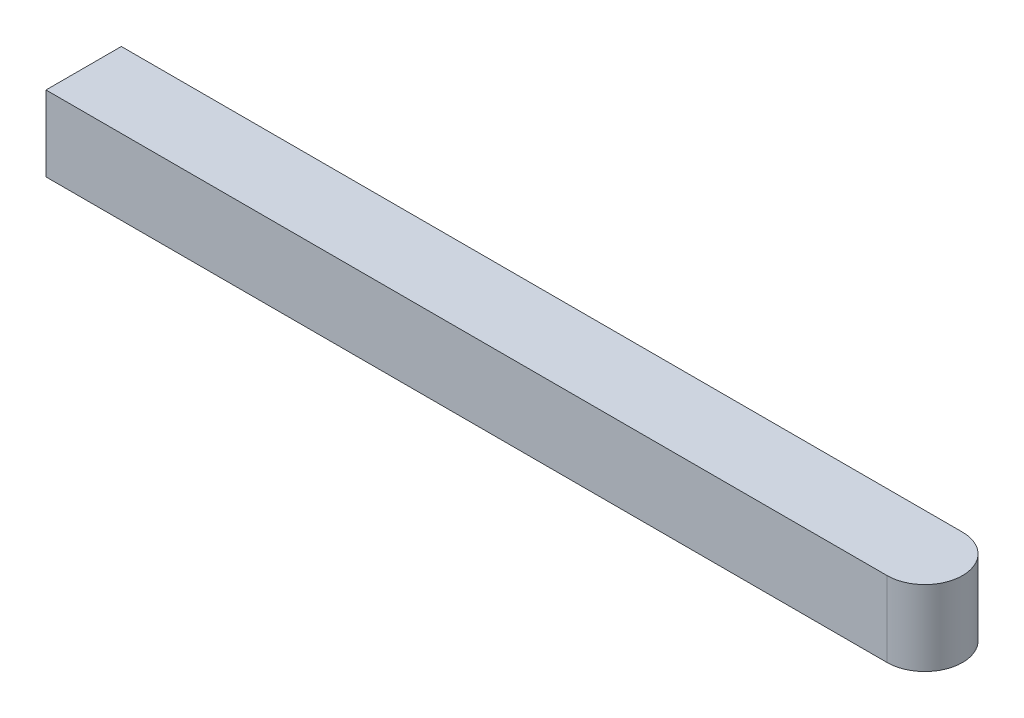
ISO-10303-21;
HEADER;
FILE_DESCRIPTION(('STEP AP214'),'2;1');
FILE_NAME('part.step','',(''),(''),'','','');
FILE_SCHEMA(('AUTOMOTIVE_DESIGN { 1 0 10303 214 1 1 1 1 }'));
ENDSEC;
DATA;
#1=APPLICATION_CONTEXT('core data for automotive mechanical design processes');
#2=APPLICATION_PROTOCOL_DEFINITION('international standard','automotive_design',2000,#1);
#3=PRODUCT_CONTEXT('',#1,'mechanical');
#4=PRODUCT('Part','Part','',(#3));
#5=PRODUCT_RELATED_PRODUCT_CATEGORY('part','',(#4));
#6=PRODUCT_DEFINITION_FORMATION('','',#4);
#7=PRODUCT_DEFINITION_CONTEXT('part definition',#1,'design');
#8=PRODUCT_DEFINITION('design','',#6,#7);
#9=PRODUCT_DEFINITION_SHAPE('','',#8);
#10=(LENGTH_UNIT() NAMED_UNIT(*) SI_UNIT(.MILLI.,.METRE.));
#11=(NAMED_UNIT(*) PLANE_ANGLE_UNIT() SI_UNIT($,.RADIAN.));
#12=(NAMED_UNIT(*) SI_UNIT($,.STERADIAN.) SOLID_ANGLE_UNIT());
#13=UNCERTAINTY_MEASURE_WITH_UNIT(LENGTH_MEASURE(1.E-05),#10,'distance_accuracy_value','');
#14=(GEOMETRIC_REPRESENTATION_CONTEXT(3) GLOBAL_UNCERTAINTY_ASSIGNED_CONTEXT((#13)) GLOBAL_UNIT_ASSIGNED_CONTEXT((#10,
#11,#12)) REPRESENTATION_CONTEXT('',''));
#15=CARTESIAN_POINT('',(0.,0.,0.));
#16=DIRECTION('',(0.,0.,1.));
#17=DIRECTION('',(1.,0.,0.));
#18=AXIS2_PLACEMENT_3D('',#15,#16,#17);
#19=CARTESIAN_POINT('',(0.,3.,-3.));
#20=DIRECTION('',(0.,0.,1.));
#21=DIRECTION('',(1.,0.,0.));
#22=AXIS2_PLACEMENT_3D('',#19,#20,#21);
#23=PLANE('',#22);
#24=DIRECTION('',(-1.,0.,0.));
#25=VECTOR('',#24,1.);
#26=CARTESIAN_POINT('',(0.,-3.,-3.));
#27=LINE('',#26,#25);
#28=CARTESIAN_POINT('',(67.,-3.,-3.));
#29=VERTEX_POINT('',#28);
#30=CARTESIAN_POINT('',(0.,-3.,-3.));
#31=VERTEX_POINT('',#30);
#32=EDGE_CURVE('E97',#29,#31,#27,.T.);
#33=ORIENTED_EDGE('',*,*,#32,.T.);
#34=DIRECTION('',(0.,-1.,0.));
#35=VECTOR('',#34,1.);
#36=CARTESIAN_POINT('',(0.,3.,-3.));
#37=LINE('',#36,#35);
#38=CARTESIAN_POINT('',(0.,3.,-3.));
#39=VERTEX_POINT('',#38);
#40=EDGE_CURVE('E11',#39,#31,#37,.T.);
#41=ORIENTED_EDGE('',*,*,#40,.F.);
#42=DIRECTION('',(-1.,0.,0.));
#43=VECTOR('',#42,1.);
#44=CARTESIAN_POINT('',(0.,3.,-3.));
#45=LINE('',#44,#43);
#46=CARTESIAN_POINT('',(67.,3.,-3.));
#47=VERTEX_POINT('',#46);
#48=EDGE_CURVE('E85',#47,#39,#45,.T.);
#49=ORIENTED_EDGE('',*,*,#48,.F.);
#50=DIRECTION('',(0.,-1.,0.));
#51=VECTOR('',#50,1.);
#52=CARTESIAN_POINT('',(67.,3.,-3.));
#53=LINE('',#52,#51);
#54=EDGE_CURVE('E93',#47,#29,#53,.T.);
#55=ORIENTED_EDGE('',*,*,#54,.T.);
#56=EDGE_LOOP('',(#33,#41,#49,#55));
#57=FACE_BOUND('',#56,.T.);
#58=ADVANCED_FACE('F34',(#57),#23,.F.);
#59=CARTESIAN_POINT('',(0.,3.,-3.));
#60=DIRECTION('',(1.,0.,0.));
#61=DIRECTION('',(0.,0.,-1.));
#62=AXIS2_PLACEMENT_3D('',#59,#60,#61);
#63=PLANE('',#62);
#64=DIRECTION('',(0.,0.,1.));
#65=VECTOR('',#64,1.);
#66=CARTESIAN_POINT('',(0.,-3.,-3.));
#67=LINE('',#66,#65);
#68=CARTESIAN_POINT('',(0.,-3.,3.));
#69=VERTEX_POINT('',#68);
#70=EDGE_CURVE('E89',#31,#69,#67,.T.);
#71=ORIENTED_EDGE('',*,*,#70,.T.);
#72=DIRECTION('',(0.,-1.,0.));
#73=VECTOR('',#72,1.);
#74=CARTESIAN_POINT('',(0.,3.,3.));
#75=LINE('',#74,#73);
#76=CARTESIAN_POINT('',(0.,3.,3.));
#77=VERTEX_POINT('',#76);
#78=EDGE_CURVE('E42',#77,#69,#75,.T.);
#79=ORIENTED_EDGE('',*,*,#78,.F.);
#80=DIRECTION('',(0.,0.,1.));
#81=VECTOR('',#80,1.);
#82=CARTESIAN_POINT('',(0.,3.,-3.));
#83=LINE('',#82,#81);
#84=EDGE_CURVE('E80',#39,#77,#83,.T.);
#85=ORIENTED_EDGE('',*,*,#84,.F.);
#86=ORIENTED_EDGE('',*,*,#40,.T.);
#87=EDGE_LOOP('',(#71,#79,#85,#86));
#88=FACE_BOUND('',#87,.T.);
#89=ADVANCED_FACE('F88',(#88),#63,.F.);
#90=CARTESIAN_POINT('',(67.,3.,3.));
#91=DIRECTION('',(0.,0.,-1.));
#92=DIRECTION('',(-1.,0.,0.));
#93=AXIS2_PLACEMENT_3D('',#90,#91,#92);
#94=PLANE('',#93);
#95=DIRECTION('',(1.,0.,0.));
#96=VECTOR('',#95,1.);
#97=CARTESIAN_POINT('',(67.,-3.,3.));
#98=LINE('',#97,#96);
#99=CARTESIAN_POINT('',(67.,-3.,3.));
#100=VERTEX_POINT('',#99);
#101=EDGE_CURVE('E67',#69,#100,#98,.T.);
#102=ORIENTED_EDGE('',*,*,#101,.T.);
#103=DIRECTION('',(0.,-1.,0.));
#104=VECTOR('',#103,1.);
#105=CARTESIAN_POINT('',(67.,3.,3.));
#106=LINE('',#105,#104);
#107=CARTESIAN_POINT('',(67.,3.,3.));
#108=VERTEX_POINT('',#107);
#109=EDGE_CURVE('E90',#108,#100,#106,.T.);
#110=ORIENTED_EDGE('',*,*,#109,.F.);
#111=DIRECTION('',(1.,0.,0.));
#112=VECTOR('',#111,1.);
#113=CARTESIAN_POINT('',(67.,3.,3.));
#114=LINE('',#113,#112);
#115=EDGE_CURVE('E83',#77,#108,#114,.T.);
#116=ORIENTED_EDGE('',*,*,#115,.F.);
#117=ORIENTED_EDGE('',*,*,#78,.T.);
#118=EDGE_LOOP('',(#102,#110,#116,#117));
#119=FACE_BOUND('',#118,.T.);
#120=ADVANCED_FACE('F91',(#119),#94,.F.);
#121=CARTESIAN_POINT('',(67.,3.,0.));
#122=DIRECTION('',(0.,-1.,0.));
#123=DIRECTION('',(0.,0.,-1.));
#124=AXIS2_PLACEMENT_3D('',#121,#122,#123);
#125=CYLINDRICAL_SURFACE('',#124,3.);
#126=CARTESIAN_POINT('',(67.,-3.,0.));
#127=DIRECTION('',(0.,1.,0.));
#128=DIRECTION('',(0.,0.,-1.));
#129=AXIS2_PLACEMENT_3D('',#126,#127,#128);
#130=CIRCLE('',#129,3.);
#131=EDGE_CURVE('E73',#100,#29,#130,.T.);
#132=ORIENTED_EDGE('',*,*,#131,.T.);
#133=ORIENTED_EDGE('',*,*,#54,.F.);
#134=CARTESIAN_POINT('',(67.,3.,0.));
#135=DIRECTION('',(0.,1.,0.));
#136=DIRECTION('',(0.,0.,-1.));
#137=AXIS2_PLACEMENT_3D('',#134,#135,#136);
#138=CIRCLE('',#137,3.);
#139=EDGE_CURVE('E50',#108,#47,#138,.T.);
#140=ORIENTED_EDGE('',*,*,#139,.F.);
#141=ORIENTED_EDGE('',*,*,#109,.T.);
#142=EDGE_LOOP('',(#132,#133,#140,#141));
#143=FACE_BOUND('',#142,.T.);
#144=ADVANCED_FACE('F104',(#143),#125,.T.);
#145=CARTESIAN_POINT('',(67.,3.,0.));
#146=DIRECTION('',(0.,-1.,0.));
#147=DIRECTION('',(0.,0.,-1.));
#148=AXIS2_PLACEMENT_3D('',#145,#146,#147);
#149=PLANE('',#148);
#150=ORIENTED_EDGE('',*,*,#48,.T.);
#151=ORIENTED_EDGE('',*,*,#84,.T.);
#152=ORIENTED_EDGE('',*,*,#115,.T.);
#153=ORIENTED_EDGE('',*,*,#139,.T.);
#154=EDGE_LOOP('',(#150,#151,#152,#153));
#155=FACE_BOUND('',#154,.T.);
#156=ADVANCED_FACE('F81',(#155),#149,.F.);
#157=CARTESIAN_POINT('',(67.,-3.,0.));
#158=DIRECTION('',(0.,-1.,0.));
#159=DIRECTION('',(0.,0.,-1.));
#160=AXIS2_PLACEMENT_3D('',#157,#158,#159);
#161=PLANE('',#160);
#162=ORIENTED_EDGE('',*,*,#32,.F.);
#163=ORIENTED_EDGE('',*,*,#131,.F.);
#164=ORIENTED_EDGE('',*,*,#101,.F.);
#165=ORIENTED_EDGE('',*,*,#70,.F.);
#166=EDGE_LOOP('',(#162,#163,#164,#165));
#167=FACE_BOUND('',#166,.T.);
#168=ADVANCED_FACE('F107',(#167),#161,.T.);
#169=CLOSED_SHELL('',(#58,#89,#120,#144,#156,#168));
#170=MANIFOLD_SOLID_BREP('B2',#169);
#171=ADVANCED_BREP_SHAPE_REPRESENTATION('',(#18,#170),#14);
#172=SHAPE_DEFINITION_REPRESENTATION(#9,#171);
ENDSEC;
END-ISO-10303-21;
